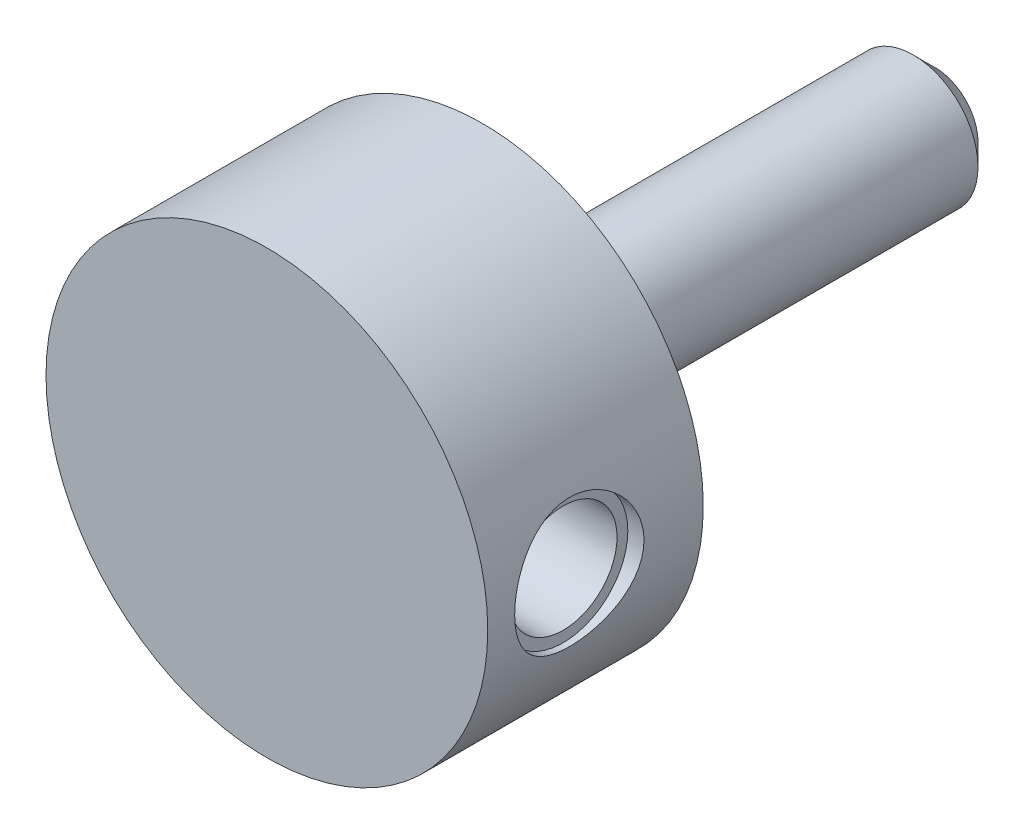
ISO-10303-21;
HEADER;
FILE_DESCRIPTION(('STEP AP214'),'2;1');
FILE_NAME('part.step','',(''),(''),'','','');
FILE_SCHEMA(('AUTOMOTIVE_DESIGN { 1 0 10303 214 1 1 1 1 }'));
ENDSEC;
DATA;
#1=APPLICATION_CONTEXT('core data for automotive mechanical design processes');
#2=APPLICATION_PROTOCOL_DEFINITION('international standard','automotive_design',2000,#1);
#3=PRODUCT_CONTEXT('',#1,'mechanical');
#4=PRODUCT('Part','Part','',(#3));
#5=PRODUCT_RELATED_PRODUCT_CATEGORY('part','',(#4));
#6=PRODUCT_DEFINITION_FORMATION('','',#4);
#7=PRODUCT_DEFINITION_CONTEXT('part definition',#1,'design');
#8=PRODUCT_DEFINITION('design','',#6,#7);
#9=PRODUCT_DEFINITION_SHAPE('','',#8);
#10=(LENGTH_UNIT() NAMED_UNIT(*) SI_UNIT(.MILLI.,.METRE.));
#11=(NAMED_UNIT(*) PLANE_ANGLE_UNIT() SI_UNIT($,.RADIAN.));
#12=(NAMED_UNIT(*) SI_UNIT($,.STERADIAN.) SOLID_ANGLE_UNIT());
#13=UNCERTAINTY_MEASURE_WITH_UNIT(LENGTH_MEASURE(1.E-05),#10,'distance_accuracy_value','');
#14=(GEOMETRIC_REPRESENTATION_CONTEXT(3) GLOBAL_UNCERTAINTY_ASSIGNED_CONTEXT((#13)) GLOBAL_UNIT_ASSIGNED_CONTEXT((#10,
#11,#12)) REPRESENTATION_CONTEXT('',''));
#15=CARTESIAN_POINT('',(0.,0.,0.));
#16=DIRECTION('',(0.,0.,1.));
#17=DIRECTION('',(1.,0.,0.));
#18=AXIS2_PLACEMENT_3D('',#15,#16,#17);
#19=CARTESIAN_POINT('',(0.,0.,0.));
#20=DIRECTION('',(0.,0.,1.));
#21=DIRECTION('',(1.,0.,0.));
#22=AXIS2_PLACEMENT_3D('',#19,#20,#21);
#23=PLANE('',#22);
#24=CARTESIAN_POINT('',(0.,0.,0.));
#25=DIRECTION('',(0.,0.,1.));
#26=DIRECTION('',(1.,0.,0.));
#27=AXIS2_PLACEMENT_3D('',#24,#25,#26);
#28=CIRCLE('',#27,9.5);
#29=CARTESIAN_POINT('',(9.5,0.,0.));
#30=VERTEX_POINT('',#29);
#31=EDGE_CURVE('E27',#30,#30,#28,.T.);
#32=ORIENTED_EDGE('',*,*,#31,.F.);
#33=EDGE_LOOP('',(#32));
#34=FACE_BOUND('',#33,.T.);
#35=CARTESIAN_POINT('',(0.,0.,0.));
#36=DIRECTION('',(0.,0.,1.));
#37=DIRECTION('',(1.,0.,0.));
#38=AXIS2_PLACEMENT_3D('',#35,#36,#37);
#39=CIRCLE('',#38,6.);
#40=CARTESIAN_POINT('',(6.,0.,0.));
#41=VERTEX_POINT('',#40);
#42=EDGE_CURVE('E23',#41,#41,#39,.F.);
#43=ORIENTED_EDGE('',*,*,#42,.F.);
#44=EDGE_LOOP('',(#43));
#45=FACE_BOUND('',#44,.T.);
#46=ADVANCED_FACE('F12',(#34,#45),#23,.F.);
#47=CARTESIAN_POINT('',(0.,0.,40.));
#48=DIRECTION('',(0.,0.,1.));
#49=DIRECTION('',(1.,0.,0.));
#50=AXIS2_PLACEMENT_3D('',#47,#48,#49);
#51=CYLINDRICAL_SURFACE('',#50,9.5);
#52=CARTESIAN_POINT('',(0.,0.,2.));
#53=DIRECTION('',(0.,0.,1.));
#54=DIRECTION('',(1.,0.,0.));
#55=AXIS2_PLACEMENT_3D('',#52,#53,#54);
#56=CIRCLE('',#55,9.5);
#57=CARTESIAN_POINT('',(9.5,0.,2.));
#58=VERTEX_POINT('',#57);
#59=EDGE_CURVE('E38',#58,#58,#56,.T.);
#60=ORIENTED_EDGE('',*,*,#59,.F.);
#61=EDGE_LOOP('',(#60));
#62=FACE_BOUND('',#61,.T.);
#63=ORIENTED_EDGE('',*,*,#31,.T.);
#64=EDGE_LOOP('',(#63));
#65=FACE_BOUND('',#64,.T.);
#66=ADVANCED_FACE('F65',(#62,#65),#51,.T.);
#67=CARTESIAN_POINT('',(20.5,0.,22.));
#68=DIRECTION('',(0.,0.,-1.));
#69=DIRECTION('',(-1.,0.,0.));
#70=AXIS2_PLACEMENT_3D('',#67,#68,#69);
#71=PLANE('',#70);
#72=CARTESIAN_POINT('',(0.,0.,22.));
#73=DIRECTION('',(0.,0.,1.));
#74=DIRECTION('',(1.,0.,0.));
#75=AXIS2_PLACEMENT_3D('',#72,#73,#74);
#76=CIRCLE('',#75,20.5);
#77=CARTESIAN_POINT('',(20.5,0.,22.));
#78=VERTEX_POINT('',#77);
#79=EDGE_CURVE('E82',#78,#78,#76,.T.);
#80=ORIENTED_EDGE('',*,*,#79,.T.);
#81=EDGE_LOOP('',(#80));
#82=FACE_BOUND('',#81,.T.);
#83=ADVANCED_FACE('F60',(#82),#71,.F.);
#84=CARTESIAN_POINT('',(0.,0.,40.));
#85=DIRECTION('',(0.,0.,1.));
#86=DIRECTION('',(1.,0.,0.));
#87=AXIS2_PLACEMENT_3D('',#84,#85,#86);
#88=CYLINDRICAL_SURFACE('',#87,20.5);
#89=CARTESIAN_POINT('',(20.5,0.,7.5));
#90=CARTESIAN_POINT('',(20.4999997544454,-0.164768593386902,7.50000038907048));
#91=CARTESIAN_POINT('',(20.4980087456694,-0.329544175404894,7.50679278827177));
#92=CARTESIAN_POINT('',(20.4900990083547,-0.65788822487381,7.5339021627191));
#93=CARTESIAN_POINT('',(20.4841800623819,-0.821456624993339,7.55421988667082));
#94=CARTESIAN_POINT('',(20.4685766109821,-1.1462122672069,7.60820100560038));
#95=CARTESIAN_POINT('',(20.4588916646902,-1.30739922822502,7.64186596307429));
#96=CARTESIAN_POINT('',(20.4360164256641,-1.62628314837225,7.72226244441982));
#97=CARTESIAN_POINT('',(20.4228249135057,-1.7839788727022,7.76899851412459));
#98=CARTESIAN_POINT('',(20.3933182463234,-2.09448185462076,7.87505403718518));
#99=CARTESIAN_POINT('',(20.3770082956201,-2.24729676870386,7.93435254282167));
#100=CARTESIAN_POINT('',(20.3416823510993,-2.54730770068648,8.06511256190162));
#101=CARTESIAN_POINT('',(20.3226662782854,-2.69450355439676,8.13657443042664));
#102=CARTESIAN_POINT('',(20.2824208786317,-2.98237032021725,8.2911456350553));
#103=CARTESIAN_POINT('',(20.2611910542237,-3.123039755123,8.37425759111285));
#104=CARTESIAN_POINT('',(20.2170775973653,-3.39691169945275,8.55150630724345));
#105=CARTESIAN_POINT('',(20.1941944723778,-3.53011647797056,8.6456396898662));
#106=CARTESIAN_POINT('',(20.146767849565,-3.79154794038,8.84682399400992));
#107=CARTESIAN_POINT('',(20.1221971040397,-3.91956600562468,8.95413966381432));
#108=CARTESIAN_POINT('',(20.0725990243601,-4.1661228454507,9.17897611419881));
#109=CARTESIAN_POINT('',(20.0475718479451,-4.2846648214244,9.29649342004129));
#110=CARTESIAN_POINT('',(19.9977175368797,-4.5116297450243,9.54108035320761));
#111=CARTESIAN_POINT('',(19.9728905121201,-4.62004743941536,9.66815487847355));
#112=CARTESIAN_POINT('',(19.9241410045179,-4.82595045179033,9.93095842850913));
#113=CARTESIAN_POINT('',(19.9002181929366,-4.92343976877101,10.0666842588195));
#114=CARTESIAN_POINT('',(19.8534354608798,-5.10885934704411,10.3490171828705));
#115=CARTESIAN_POINT('',(19.8306098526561,-5.19653638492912,10.4957964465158));
#116=CARTESIAN_POINT('',(19.7872868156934,-5.35913808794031,10.7965125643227));
#117=CARTESIAN_POINT('',(19.766788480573,-5.43406772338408,10.9504465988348));
#118=CARTESIAN_POINT('',(19.7287391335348,-5.57062666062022,11.2645036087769));
#119=CARTESIAN_POINT('',(19.7111887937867,-5.63225293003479,11.4246279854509));
#120=CARTESIAN_POINT('',(19.6796082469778,-5.74162541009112,11.7498143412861));
#121=CARTESIAN_POINT('',(19.6655765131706,-5.78937764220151,11.9148741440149));
#122=CARTESIAN_POINT('',(19.6418018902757,-5.86952471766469,12.2443484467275));
#123=CARTESIAN_POINT('',(19.6319555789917,-5.90229162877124,12.4086649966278));
#124=CARTESIAN_POINT('',(19.6163432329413,-5.95397424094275,12.7395899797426));
#125=CARTESIAN_POINT('',(19.6105755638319,-5.97289549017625,12.9061974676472));
#126=CARTESIAN_POINT('',(19.603301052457,-5.99672775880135,13.2405034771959));
#127=CARTESIAN_POINT('',(19.6017941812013,-6.00163887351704,13.4082019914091));
#128=CARTESIAN_POINT('',(19.6030905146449,-5.99740342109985,13.7434027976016));
#129=CARTESIAN_POINT('',(19.6058936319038,-5.98825713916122,13.9109050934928));
#130=CARTESIAN_POINT('',(19.6155486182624,-5.95655212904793,14.238688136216));
#131=CARTESIAN_POINT('',(19.6222578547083,-5.9344657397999,14.3990190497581));
#132=CARTESIAN_POINT('',(19.6394095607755,-5.87745500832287,14.7172343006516));
#133=CARTESIAN_POINT('',(19.649853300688,-5.84252629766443,14.8751177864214));
#134=CARTESIAN_POINT('',(19.6741615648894,-5.7601395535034,15.187257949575));
#135=CARTESIAN_POINT('',(19.688025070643,-5.71268525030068,15.3415156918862));
#136=CARTESIAN_POINT('',(19.7187796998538,-5.60560692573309,15.6454959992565));
#137=CARTESIAN_POINT('',(19.7356719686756,-5.5459782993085,15.7952168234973));
#138=CARTESIAN_POINT('',(19.7722410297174,-5.41416819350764,16.0910079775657));
#139=CARTESIAN_POINT('',(19.7919506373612,-5.34183608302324,16.2370072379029));
#140=CARTESIAN_POINT('',(19.8334359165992,-5.18568691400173,16.5224423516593));
#141=CARTESIAN_POINT('',(19.8552123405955,-5.10186566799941,16.6618757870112));
#142=CARTESIAN_POINT('',(19.9227548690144,-4.8340177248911,17.0689782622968));
#143=CARTESIAN_POINT('',(19.9707648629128,-4.63350124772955,17.3256854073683));
#144=CARTESIAN_POINT('',(20.0696162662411,-4.18511260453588,17.8126329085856));
#145=CARTESIAN_POINT('',(20.1204944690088,-3.93567819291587,18.0414205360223));
#146=CARTESIAN_POINT('',(20.2176813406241,-3.40132203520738,18.4542852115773));
#147=CARTESIAN_POINT('',(20.2639897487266,-3.11639826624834,18.63835970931));
#148=CARTESIAN_POINT('',(20.3472018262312,-2.51664006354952,18.9573414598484));
#149=CARTESIAN_POINT('',(20.3840462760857,-2.2016334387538,19.0919412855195));
#150=CARTESIAN_POINT('',(20.4437541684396,-1.55212614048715,19.3058343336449));
#151=CARTESIAN_POINT('',(20.4666213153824,-1.21763065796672,19.3851422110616));
#152=CARTESIAN_POINT('',(20.4952175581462,-0.550953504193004,19.4838192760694));
#153=CARTESIAN_POINT('',(20.5015074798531,-0.219085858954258,19.5051506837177));
#154=CARTESIAN_POINT('',(20.4978783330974,0.44350281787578,19.4927506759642));
#155=CARTESIAN_POINT('',(20.4879613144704,0.774223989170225,19.4590262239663));
#156=CARTESIAN_POINT('',(20.4533992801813,1.41781519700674,19.3390673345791));
#157=CARTESIAN_POINT('',(20.4290727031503,1.73091547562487,19.253967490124));
#158=CARTESIAN_POINT('',(20.3684901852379,2.33834273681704,19.0350155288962));
#159=CARTESIAN_POINT('',(20.3322328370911,2.63266749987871,18.901157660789));
#160=CARTESIAN_POINT('',(20.2505580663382,3.201467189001,18.585163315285));
#161=CARTESIAN_POINT('',(20.2049537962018,3.47535043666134,18.4020133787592));
#162=CARTESIAN_POINT('',(20.1098009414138,3.98926947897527,17.9937010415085));
#163=CARTESIAN_POINT('',(20.0602514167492,4.22929716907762,17.7685286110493));
#164=CARTESIAN_POINT('',(19.9860369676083,4.56311282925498,17.3996018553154));
#165=CARTESIAN_POINT('',(19.9608943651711,4.67160496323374,17.2689475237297));
#166=CARTESIAN_POINT('',(19.9116554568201,4.87720494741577,16.9988051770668));
#167=CARTESIAN_POINT('',(19.8875587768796,4.97431688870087,16.8593203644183));
#168=CARTESIAN_POINT('',(19.8411019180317,5.15650338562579,16.5723575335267));
#169=CARTESIAN_POINT('',(19.8187424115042,5.24157329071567,16.4248764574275));
#170=CARTESIAN_POINT('',(19.7764458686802,5.39896546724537,16.1230001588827));
#171=CARTESIAN_POINT('',(19.7565078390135,5.47129297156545,15.9686078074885));
#172=CARTESIAN_POINT('',(19.7197444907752,5.60234699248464,15.6546484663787));
#173=CARTESIAN_POINT('',(19.7029051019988,5.6611353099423,15.49510893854));
#174=CARTESIAN_POINT('',(19.6727610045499,5.76501533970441,15.1713718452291));
#175=CARTESIAN_POINT('',(19.6594548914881,5.81011249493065,15.0071761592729));
#176=CARTESIAN_POINT('',(19.6367999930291,5.88622676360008,14.675294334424));
#177=CARTESIAN_POINT('',(19.6274509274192,5.91724487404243,14.5076084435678));
#178=CARTESIAN_POINT('',(19.6130187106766,5.96490739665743,14.1700260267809));
#179=CARTESIAN_POINT('',(19.6079354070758,5.98155232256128,14.0001295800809));
#180=CARTESIAN_POINT('',(19.6023186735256,5.9999323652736,13.6662567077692));
#181=CARTESIAN_POINT('',(19.6016119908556,6.00223524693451,13.5023141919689));
#182=CARTESIAN_POINT('',(19.6043094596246,5.99341910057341,13.1747666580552));
#183=CARTESIAN_POINT('',(19.6077150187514,5.98229547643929,13.0111617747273));
#184=CARTESIAN_POINT('',(19.6185313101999,5.94672790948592,12.6856110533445));
#185=CARTESIAN_POINT('',(19.6259403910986,5.92228945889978,12.5236645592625));
#186=CARTESIAN_POINT('',(19.6445384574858,5.86030325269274,12.2024601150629));
#187=CARTESIAN_POINT('',(19.6557288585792,5.82275058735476,12.0432031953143));
#188=CARTESIAN_POINT('',(19.6814005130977,5.73537439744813,11.7303823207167));
#189=CARTESIAN_POINT('',(19.6958418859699,5.68569901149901,11.5767736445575));
#190=CARTESIAN_POINT('',(19.7276768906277,5.57423736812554,11.2742707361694));
#191=CARTESIAN_POINT('',(19.7450715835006,5.51244675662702,11.125378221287));
#192=CARTESIAN_POINT('',(19.782319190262,5.37724463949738,10.8333301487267));
#193=CARTESIAN_POINT('',(19.802171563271,5.30383568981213,10.6901733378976));
#194=CARTESIAN_POINT('',(19.8438063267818,5.14587421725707,10.4103722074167));
#195=CARTESIAN_POINT('',(19.8655894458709,5.061317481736,10.2737303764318));
#196=CARTESIAN_POINT('',(19.9112797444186,4.87853600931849,10.0032239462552));
#197=CARTESIAN_POINT('',(19.9352342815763,4.77994030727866,9.86961789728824));
#198=CARTESIAN_POINT('',(19.9839347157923,4.57206196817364,9.61107007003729));
#199=CARTESIAN_POINT('',(20.0086809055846,4.46277534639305,9.48613155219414));
#200=CARTESIAN_POINT('',(20.0582834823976,4.23425660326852,9.24575891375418));
#201=CARTESIAN_POINT('',(20.0831398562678,4.11502564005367,9.13032368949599));
#202=CARTESIAN_POINT('',(20.1323098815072,3.86730499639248,8.90963180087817));
#203=CARTESIAN_POINT('',(20.1566233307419,3.7388119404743,8.80437888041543));
#204=CARTESIAN_POINT('',(20.2046974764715,3.46977987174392,8.6020699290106));
#205=CARTESIAN_POINT('',(20.2284250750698,3.32900807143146,8.50531528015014));
#206=CARTESIAN_POINT('',(20.2739466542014,3.03949915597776,8.32403500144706));
#207=CARTESIAN_POINT('',(20.2957406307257,2.8907620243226,8.23950939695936));
#208=CARTESIAN_POINT('',(20.3367679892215,2.58639447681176,8.0833769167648));
#209=CARTESIAN_POINT('',(20.356002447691,2.43076699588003,8.01176460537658));
#210=CARTESIAN_POINT('',(20.3913677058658,2.11366097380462,7.88201306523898));
#211=CARTESIAN_POINT('',(20.4074988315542,1.95218304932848,7.82387242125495));
#212=CARTESIAN_POINT('',(20.4344672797,1.64423058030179,7.72771145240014));
#213=CARTESIAN_POINT('',(20.4457076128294,1.49828162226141,7.68811373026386));
#214=CARTESIAN_POINT('',(20.4651675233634,1.2036242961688,7.62002138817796));
#215=CARTESIAN_POINT('',(20.4733873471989,1.0549161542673,7.59152586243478));
#216=CARTESIAN_POINT('',(20.4866168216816,0.755624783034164,7.54584620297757));
#217=CARTESIAN_POINT('',(20.491626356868,0.605041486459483,7.52866247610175));
#218=CARTESIAN_POINT('',(20.49831762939,0.302973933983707,7.50574067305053));
#219=CARTESIAN_POINT('',(20.5000002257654,0.151489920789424,7.49999964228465));
#220=CARTESIAN_POINT('',(20.5,0.,7.5));
#221=B_SPLINE_CURVE_WITH_KNOTS('',3,(#89,#90,#91,#92,#93,#94,#95,#96,#97,#98,#99,#100,#101,#102,
#103,#104,#105,#106,#107,#108,#109,#110,#111,#112,#113,#114,#115,#116,#117,#118,#119,#120,#121,
#122,#123,#124,#125,#126,#127,#128,#129,#130,#131,#132,#133,#134,#135,#136,#137,#138,#139,#140,
#141,#142,#143,#144,#145,#146,#147,#148,#149,#150,#151,#152,#153,#154,#155,#156,#157,#158,#159,
#160,#161,#162,#163,#164,#165,#166,#167,#168,#169,#170,#171,#172,#173,#174,#175,#176,#177,#178,
#179,#180,#181,#182,#183,#184,#185,#186,#187,#188,#189,#190,#191,#192,#193,#194,#195,#196,#197,
#198,#199,#200,#201,#202,#203,#204,#205,#206,#207,#208,#209,#210,#211,#212,#213,#214,#215,#216,
#217,#218,#219,#220),.UNSPECIFIED.,.T.,.F.,(4,2,2,2,2,2,2,2,2,2,2,2,2,2,2,2,2,2,2,2,2,2,2,2,2,2,
2,2,2,2,2,2,2,2,2,2,2,2,2,2,2,2,2,2,2,2,2,2,2,2,2,2,2,2,2,2,2,2,2,2,2,2,2,2,2,4),(0.,
0.494166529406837,0.988360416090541,1.48261217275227,1.97703603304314,2.47064184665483,
2.96426207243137,3.45799348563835,3.95157399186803,4.45753270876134,4.96331976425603,
5.46936781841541,5.97523008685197,6.49206535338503,7.00869863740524,7.52544955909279,
8.04197586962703,8.54486934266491,9.04756118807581,9.55024961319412,10.0529278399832,
10.5383093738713,11.0238561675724,11.5092585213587,11.9948448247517,12.4866344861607,
12.9786038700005,13.9617709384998,14.9839152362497,16.006117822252,17.0345689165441,
18.062747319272,19.0556662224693,20.0484595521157,21.0200911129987,21.9918373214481,
22.9853318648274,23.97906383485,24.4935931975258,25.0079370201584,25.5224789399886,
26.0368090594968,26.5487427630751,27.0604726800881,27.5721663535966,28.0838417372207,
28.5751252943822,29.066577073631,29.5578262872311,30.0492596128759,30.5349645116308,
31.0208442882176,31.5066173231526,31.9925744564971,32.4953010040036,32.9982156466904,
33.5010718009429,34.0041121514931,34.5208552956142,35.0375995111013,35.5541256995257,
36.0705976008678,36.525077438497,36.9795201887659,37.4339792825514,37.8883210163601),.UNSPECIFIED.);
#222=CARTESIAN_POINT('',(20.5,0.,7.5));
#223=VERTEX_POINT('',#222);
#224=EDGE_CURVE('E30',#223,#223,#221,.T.);
#225=ORIENTED_EDGE('',*,*,#224,.T.);
#226=EDGE_LOOP('',(#225));
#227=FACE_BOUND('',#226,.T.);
#228=ORIENTED_EDGE('',*,*,#79,.F.);
#229=EDGE_LOOP('',(#228));
#230=FACE_BOUND('',#229,.T.);
#231=CARTESIAN_POINT('',(0.,0.,2.));
#232=DIRECTION('',(0.,0.,1.));
#233=DIRECTION('',(1.,0.,0.));
#234=AXIS2_PLACEMENT_3D('',#231,#232,#233);
#235=CIRCLE('',#234,20.5);
#236=CARTESIAN_POINT('',(20.5,0.,2.));
#237=VERTEX_POINT('',#236);
#238=EDGE_CURVE('E84',#237,#237,#235,.T.);
#239=ORIENTED_EDGE('',*,*,#238,.T.);
#240=EDGE_LOOP('',(#239));
#241=FACE_BOUND('',#240,.T.);
#242=ADVANCED_FACE('F41',(#227,#230,#241),#88,.T.);
#243=CARTESIAN_POINT('',(9.5,0.,2.));
#244=DIRECTION('',(0.,0.,1.));
#245=DIRECTION('',(1.,0.,0.));
#246=AXIS2_PLACEMENT_3D('',#243,#244,#245);
#247=PLANE('',#246);
#248=ORIENTED_EDGE('',*,*,#238,.F.);
#249=EDGE_LOOP('',(#248));
#250=FACE_BOUND('',#249,.T.);
#251=ORIENTED_EDGE('',*,*,#59,.T.);
#252=EDGE_LOOP('',(#251));
#253=FACE_BOUND('',#252,.T.);
#254=ADVANCED_FACE('F49',(#250,#253),#247,.F.);
#255=CARTESIAN_POINT('',(19.,0.,13.5));
#256=DIRECTION('',(1.,0.,0.));
#257=DIRECTION('',(0.,0.,-1.));
#258=AXIS2_PLACEMENT_3D('',#255,#256,#257);
#259=CYLINDRICAL_SURFACE('',#258,6.);
#260=CARTESIAN_POINT('',(19.,0.,13.5));
#261=DIRECTION('',(1.,0.,0.));
#262=DIRECTION('',(0.,0.,-1.));
#263=AXIS2_PLACEMENT_3D('',#260,#261,#262);
#264=CIRCLE('',#263,6.);
#265=CARTESIAN_POINT('',(19.,0.,7.5));
#266=VERTEX_POINT('',#265);
#267=EDGE_CURVE('E39',#266,#266,#264,.T.);
#268=ORIENTED_EDGE('',*,*,#267,.F.);
#269=EDGE_LOOP('',(#268));
#270=FACE_BOUND('',#269,.T.);
#271=ORIENTED_EDGE('',*,*,#224,.F.);
#272=EDGE_LOOP('',(#271));
#273=FACE_BOUND('',#272,.T.);
#274=ADVANCED_FACE('F47',(#270,#273),#259,.F.);
#275=CARTESIAN_POINT('',(19.,0.,13.5));
#276=DIRECTION('',(1.,0.,0.));
#277=DIRECTION('',(0.,0.,-1.));
#278=AXIS2_PLACEMENT_3D('',#275,#276,#277);
#279=PLANE('',#278);
#280=CARTESIAN_POINT('',(19.,0.,13.5));
#281=DIRECTION('',(1.,0.,0.));
#282=DIRECTION('',(0.,0.,-1.));
#283=AXIS2_PLACEMENT_3D('',#280,#281,#282);
#284=CIRCLE('',#283,5.);
#285=CARTESIAN_POINT('',(19.,0.,8.5));
#286=VERTEX_POINT('',#285);
#287=EDGE_CURVE('E96',#286,#286,#284,.T.);
#288=ORIENTED_EDGE('',*,*,#287,.F.);
#289=EDGE_LOOP('',(#288));
#290=FACE_BOUND('',#289,.T.);
#291=ORIENTED_EDGE('',*,*,#267,.T.);
#292=EDGE_LOOP('',(#291));
#293=FACE_BOUND('',#292,.T.);
#294=ADVANCED_FACE('F58',(#290,#293),#279,.T.);
#295=CARTESIAN_POINT('',(10.,0.,13.5));
#296=DIRECTION('',(1.,0.,0.));
#297=DIRECTION('',(0.,0.,-1.));
#298=AXIS2_PLACEMENT_3D('',#295,#296,#297);
#299=CYLINDRICAL_SURFACE('',#298,5.);
#300=CARTESIAN_POINT('',(10.,0.,13.5));
#301=DIRECTION('',(1.,0.,0.));
#302=DIRECTION('',(0.,0.,-1.));
#303=AXIS2_PLACEMENT_3D('',#300,#301,#302);
#304=CIRCLE('',#303,5.);
#305=CARTESIAN_POINT('',(10.,0.,8.5));
#306=VERTEX_POINT('',#305);
#307=EDGE_CURVE('E93',#306,#306,#304,.T.);
#308=ORIENTED_EDGE('',*,*,#307,.F.);
#309=EDGE_LOOP('',(#308));
#310=FACE_BOUND('',#309,.T.);
#311=ORIENTED_EDGE('',*,*,#287,.T.);
#312=EDGE_LOOP('',(#311));
#313=FACE_BOUND('',#312,.T.);
#314=ADVANCED_FACE('F100',(#310,#313),#299,.F.);
#315=CARTESIAN_POINT('',(10.,0.,13.5));
#316=DIRECTION('',(1.,0.,0.));
#317=DIRECTION('',(0.,0.,-1.));
#318=AXIS2_PLACEMENT_3D('',#315,#316,#317);
#319=PLANE('',#318);
#320=ORIENTED_EDGE('',*,*,#307,.T.);
#321=EDGE_LOOP('',(#320));
#322=FACE_BOUND('',#321,.T.);
#323=ADVANCED_FACE('F112',(#322),#319,.T.);
#324=CARTESIAN_POINT('',(0.,0.,-40.));
#325=DIRECTION('',(0.,0.,1.));
#326=DIRECTION('',(1.,0.,0.));
#327=AXIS2_PLACEMENT_3D('',#324,#325,#326);
#328=CYLINDRICAL_SURFACE('',#327,6.);
#329=CARTESIAN_POINT('',(0.,0.,-38.));
#330=DIRECTION('',(0.,0.,-1.));
#331=DIRECTION('',(-1.,0.,0.));
#332=AXIS2_PLACEMENT_3D('',#329,#330,#331);
#333=CIRCLE('',#332,6.);
#334=CARTESIAN_POINT('',(-6.,0.,-38.));
#335=VERTEX_POINT('',#334);
#336=EDGE_CURVE('E8',#335,#335,#333,.F.);
#337=ORIENTED_EDGE('',*,*,#336,.T.);
#338=EDGE_LOOP('',(#337));
#339=FACE_BOUND('',#338,.T.);
#340=ORIENTED_EDGE('',*,*,#42,.T.);
#341=EDGE_LOOP('',(#340));
#342=FACE_BOUND('',#341,.T.);
#343=ADVANCED_FACE('F118',(#339,#342),#328,.T.);
#344=CARTESIAN_POINT('',(0.,0.,-40.));
#345=DIRECTION('',(0.,0.,-1.));
#346=DIRECTION('',(-1.,0.,0.));
#347=AXIS2_PLACEMENT_3D('',#344,#345,#346);
#348=PLANE('',#347);
#349=CARTESIAN_POINT('',(0.,0.,-40.));
#350=DIRECTION('',(0.,0.,-1.));
#351=DIRECTION('',(-1.,0.,0.));
#352=AXIS2_PLACEMENT_3D('',#349,#350,#351);
#353=CIRCLE('',#352,4.);
#354=CARTESIAN_POINT('',(-4.,0.,-40.));
#355=VERTEX_POINT('',#354);
#356=EDGE_CURVE('E19',#355,#355,#353,.T.);
#357=ORIENTED_EDGE('',*,*,#356,.T.);
#358=EDGE_LOOP('',(#357));
#359=FACE_BOUND('',#358,.T.);
#360=ADVANCED_FACE('F122',(#359),#348,.T.);
#361=CARTESIAN_POINT('',(0.,0.,-40.));
#362=DIRECTION('',(0.,0.,1.));
#363=DIRECTION('',(1.,0.,0.));
#364=AXIS2_PLACEMENT_3D('',#361,#362,#363);
#365=CONICAL_SURFACE('',#364,4.,0.785398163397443);
#366=ORIENTED_EDGE('',*,*,#336,.F.);
#367=EDGE_LOOP('',(#366));
#368=FACE_BOUND('',#367,.T.);
#369=ORIENTED_EDGE('',*,*,#356,.F.);
#370=EDGE_LOOP('',(#369));
#371=FACE_BOUND('',#370,.T.);
#372=ADVANCED_FACE('F14',(#368,#371),#365,.T.);
#373=CLOSED_SHELL('',(#46,#66,#83,#242,#254,#274,#294,#314,#323,#343,#360,#372));
#374=MANIFOLD_SOLID_BREP('B1',#373);
#375=ADVANCED_BREP_SHAPE_REPRESENTATION('',(#18,#374),#14);
#376=SHAPE_DEFINITION_REPRESENTATION(#9,#375);
ENDSEC;
END-ISO-10303-21;
